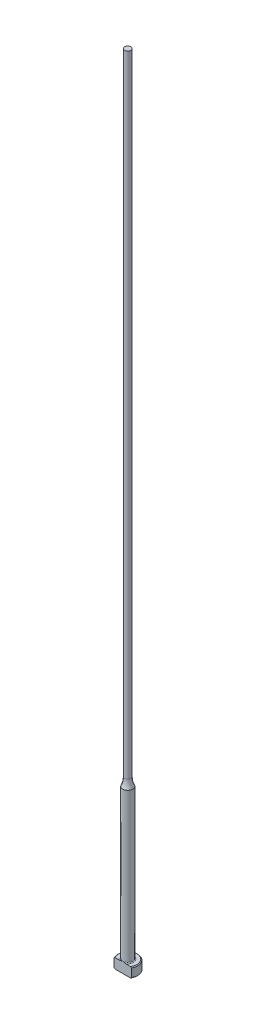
from build123d import *

# Parameters (mm, degrees)
CHAMFER1_SIZE = 0.254
FILLET1_R     = 0.254
KEY_DEPTH     = 255.0396844


with BuildPart() as part:
    # Sketch1 → Revolve1 (revolve)
    with BuildSketch(Plane.XY, mode=Mode.PRIVATE) as revolve1_sk:
        with BuildLine():
            Line((0, 0), (-3.175, 0))
            Line((-3.175, 0), (-3.175, 3.175))
            Line((-3.175, 3.175), (-1.5875, 3.175))
            Line((-1.5875, 3.175), (-1.5875, 50.8))
            ThreePointArc((-1.5875, 50.8), (-1.142565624, 52.109911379), (-0.99187, 53.485093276))
            Line((-0.99187, 53.485093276), (-0.99187, 254))
            Line((-0.99187, 254), (0, 254))
            Line((0, 254), (0, 0))
        make_face()
    revolve(revolve1_sk.sketch.rotate(Axis((0, 259.958771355, 0), (0, -1, 0)), 270), axis=Axis((0, 259.958771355, 0), (0, -1, 0)))

    # Chamfer1
    chamfer1_edges = [part.edges().sort_by_distance(p)[0] for p in [
        (0, 0, -3.175),
        (0, 3.175, -3.175),
    ]]
    chamfer(chamfer1_edges, length=CHAMFER1_SIZE)

    # Fillet1
    fillet1_edges = [part.edges().sort_by_distance(p)[0] for p in [
        (0, 3.175, -1.5875),
    ]]
    fillet(fillet1_edges, radius=FILLET1_R)

    # Sketch2 → KEY (cut, through all)
    with BuildSketch(Plane.XZ):
        with BuildLine():
            Line((-2.749630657, 1.5875), (2.749630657, 1.5875))
            ThreePointArc((2.749630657, 1.5875), (0, 3.175), (-2.749630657, 1.5875))
        make_face()
    extrude(amount=-KEY_DEPTH, mode=Mode.SUBTRACT)


solid = part.part
